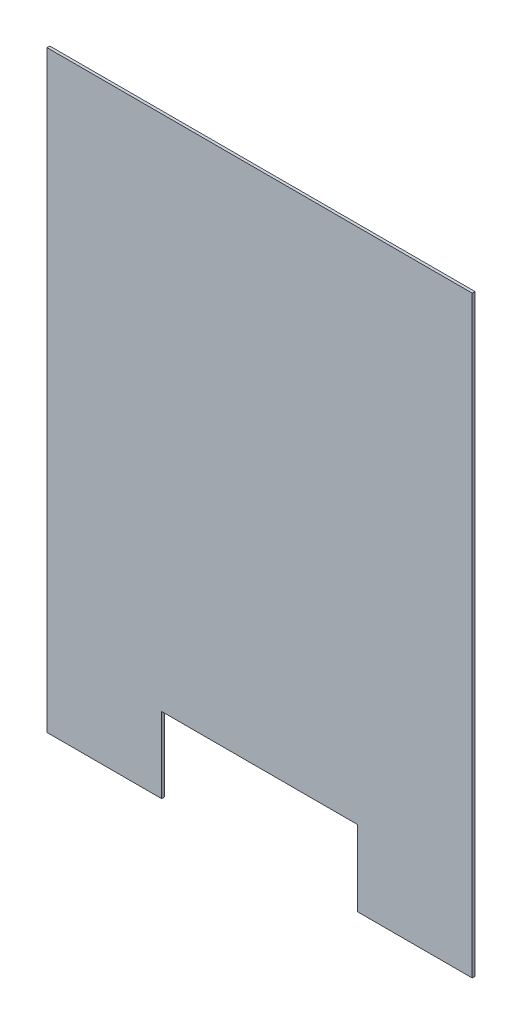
ISO-10303-21;
HEADER;
FILE_DESCRIPTION(('STEP AP214'),'2;1');
FILE_NAME('part.step','',(''),(''),'','','');
FILE_SCHEMA(('AUTOMOTIVE_DESIGN { 1 0 10303 214 1 1 1 1 }'));
ENDSEC;
DATA;
#1=APPLICATION_CONTEXT('core data for automotive mechanical design processes');
#2=APPLICATION_PROTOCOL_DEFINITION('international standard','automotive_design',2000,#1);
#3=PRODUCT_CONTEXT('',#1,'mechanical');
#4=PRODUCT('Part','Part','',(#3));
#5=PRODUCT_RELATED_PRODUCT_CATEGORY('part','',(#4));
#6=PRODUCT_DEFINITION_FORMATION('','',#4);
#7=PRODUCT_DEFINITION_CONTEXT('part definition',#1,'design');
#8=PRODUCT_DEFINITION('design','',#6,#7);
#9=PRODUCT_DEFINITION_SHAPE('','',#8);
#10=(LENGTH_UNIT() NAMED_UNIT(*) SI_UNIT(.MILLI.,.METRE.));
#11=(NAMED_UNIT(*) PLANE_ANGLE_UNIT() SI_UNIT($,.RADIAN.));
#12=(NAMED_UNIT(*) SI_UNIT($,.STERADIAN.) SOLID_ANGLE_UNIT());
#13=UNCERTAINTY_MEASURE_WITH_UNIT(LENGTH_MEASURE(1.E-05),#10,'distance_accuracy_value','');
#14=(GEOMETRIC_REPRESENTATION_CONTEXT(3) GLOBAL_UNCERTAINTY_ASSIGNED_CONTEXT((#13)) GLOBAL_UNIT_ASSIGNED_CONTEXT((#10,
#11,#12)) REPRESENTATION_CONTEXT('',''));
#15=CARTESIAN_POINT('',(0.,0.,0.));
#16=DIRECTION('',(0.,0.,1.));
#17=DIRECTION('',(1.,0.,0.));
#18=AXIS2_PLACEMENT_3D('',#15,#16,#17);
#19=CARTESIAN_POINT('',(-15.2,-21.2,5.8));
#20=DIRECTION('',(0.,1.,0.));
#21=DIRECTION('',(0.,0.,1.));
#22=AXIS2_PLACEMENT_3D('',#19,#20,#21);
#23=PLANE('',#22);
#24=DIRECTION('',(0.,0.,-1.));
#25=VECTOR('',#24,1.);
#26=CARTESIAN_POINT('',(-7.,-21.2,5.8));
#27=LINE('',#26,#25);
#28=CARTESIAN_POINT('',(-7.,-21.2,5.8));
#29=VERTEX_POINT('',#28);
#30=CARTESIAN_POINT('',(-7.,-21.2,5.6));
#31=VERTEX_POINT('',#30);
#32=EDGE_CURVE('E139',#29,#31,#27,.T.);
#33=ORIENTED_EDGE('',*,*,#32,.F.);
#34=DIRECTION('',(1.,0.,0.));
#35=VECTOR('',#34,1.);
#36=CARTESIAN_POINT('',(-15.2,-21.2,5.8));
#37=LINE('',#36,#35);
#38=CARTESIAN_POINT('',(-15.2,-21.2,5.8));
#39=VERTEX_POINT('',#38);
#40=EDGE_CURVE('E107',#39,#29,#37,.T.);
#41=ORIENTED_EDGE('',*,*,#40,.F.);
#42=DIRECTION('',(0.,0.,-1.));
#43=VECTOR('',#42,1.);
#44=CARTESIAN_POINT('',(-15.2,-21.2,5.8));
#45=LINE('',#44,#43);
#46=CARTESIAN_POINT('',(-15.2,-21.2,5.6));
#47=VERTEX_POINT('',#46);
#48=EDGE_CURVE('E51',#39,#47,#45,.T.);
#49=ORIENTED_EDGE('',*,*,#48,.T.);
#50=DIRECTION('',(1.,0.,0.));
#51=VECTOR('',#50,1.);
#52=CARTESIAN_POINT('',(-15.2,-21.2,5.6));
#53=LINE('',#52,#51);
#54=EDGE_CURVE('E134',#47,#31,#53,.T.);
#55=ORIENTED_EDGE('',*,*,#54,.T.);
#56=EDGE_LOOP('',(#33,#41,#49,#55));
#57=FACE_BOUND('',#56,.T.);
#58=ADVANCED_FACE('F41',(#57),#23,.F.);
#59=DIRECTION('',(0.,0.,1.));
#60=VECTOR('',#59,1.);
#61=CARTESIAN_POINT('',(7.,-21.2,5.8));
#62=LINE('',#61,#60);
#63=CARTESIAN_POINT('',(7.,-21.2,5.6));
#64=VERTEX_POINT('',#63);
#65=CARTESIAN_POINT('',(7.,-21.2,5.8));
#66=VERTEX_POINT('',#65);
#67=EDGE_CURVE('E147',#64,#66,#62,.T.);
#68=ORIENTED_EDGE('',*,*,#67,.F.);
#69=CARTESIAN_POINT('',(15.2,-21.2,5.6));
#70=VERTEX_POINT('',#69);
#71=EDGE_CURVE('E133',#64,#70,#53,.T.);
#72=ORIENTED_EDGE('',*,*,#71,.T.);
#73=DIRECTION('',(0.,0.,-1.));
#74=VECTOR('',#73,1.);
#75=CARTESIAN_POINT('',(15.2,-21.2,5.8));
#76=LINE('',#75,#74);
#77=CARTESIAN_POINT('',(15.2,-21.2,5.8));
#78=VERTEX_POINT('',#77);
#79=EDGE_CURVE('E116',#78,#70,#76,.T.);
#80=ORIENTED_EDGE('',*,*,#79,.F.);
#81=EDGE_CURVE('E144',#66,#78,#37,.T.);
#82=ORIENTED_EDGE('',*,*,#81,.F.);
#83=EDGE_LOOP('',(#68,#72,#80,#82));
#84=FACE_BOUND('',#83,.T.);
#85=ADVANCED_FACE('F159',(#84),#23,.F.);
#86=CARTESIAN_POINT('',(0.,0.,5.8));
#87=DIRECTION('',(0.,0.,-1.));
#88=DIRECTION('',(-1.,0.,0.));
#89=AXIS2_PLACEMENT_3D('',#86,#87,#88);
#90=PLANE('',#89);
#91=DIRECTION('',(0.,-1.,0.));
#92=VECTOR('',#91,1.);
#93=CARTESIAN_POINT('',(-7.,0.,5.8));
#94=LINE('',#93,#92);
#95=CARTESIAN_POINT('',(-7.,-15.8,5.8));
#96=VERTEX_POINT('',#95);
#97=EDGE_CURVE('E44',#96,#29,#94,.T.);
#98=ORIENTED_EDGE('',*,*,#97,.F.);
#99=DIRECTION('',(-1.,0.,0.));
#100=VECTOR('',#99,1.);
#101=CARTESIAN_POINT('',(0.,-15.8,5.8));
#102=LINE('',#101,#100);
#103=CARTESIAN_POINT('',(7.,-15.8,5.8));
#104=VERTEX_POINT('',#103);
#105=EDGE_CURVE('E82',#104,#96,#102,.T.);
#106=ORIENTED_EDGE('',*,*,#105,.F.);
#107=DIRECTION('',(0.,1.,0.));
#108=VECTOR('',#107,1.);
#109=CARTESIAN_POINT('',(7.,0.,5.8));
#110=LINE('',#109,#108);
#111=EDGE_CURVE('E94',#66,#104,#110,.T.);
#112=ORIENTED_EDGE('',*,*,#111,.F.);
#113=ORIENTED_EDGE('',*,*,#81,.T.);
#114=DIRECTION('',(0.,1.,0.));
#115=VECTOR('',#114,1.);
#116=CARTESIAN_POINT('',(15.2,-21.2,5.8));
#117=LINE('',#116,#115);
#118=CARTESIAN_POINT('',(15.2,21.2,5.8));
#119=VERTEX_POINT('',#118);
#120=EDGE_CURVE('E142',#78,#119,#117,.T.);
#121=ORIENTED_EDGE('',*,*,#120,.T.);
#122=DIRECTION('',(-1.,0.,0.));
#123=VECTOR('',#122,1.);
#124=CARTESIAN_POINT('',(-15.2,21.2,5.8));
#125=LINE('',#124,#123);
#126=CARTESIAN_POINT('',(-15.2,21.2,5.8));
#127=VERTEX_POINT('',#126);
#128=EDGE_CURVE('E124',#119,#127,#125,.T.);
#129=ORIENTED_EDGE('',*,*,#128,.T.);
#130=DIRECTION('',(0.,-1.,0.));
#131=VECTOR('',#130,1.);
#132=CARTESIAN_POINT('',(-15.2,-21.2,5.8));
#133=LINE('',#132,#131);
#134=EDGE_CURVE('E129',#127,#39,#133,.T.);
#135=ORIENTED_EDGE('',*,*,#134,.T.);
#136=ORIENTED_EDGE('',*,*,#40,.T.);
#137=EDGE_LOOP('',(#98,#106,#112,#113,#121,#129,#135,#136));
#138=FACE_BOUND('',#137,.T.);
#139=ADVANCED_FACE('F104',(#138),#90,.F.);
#140=CARTESIAN_POINT('',(0.,0.,5.6));
#141=DIRECTION('',(0.,0.,-1.));
#142=DIRECTION('',(-1.,0.,0.));
#143=AXIS2_PLACEMENT_3D('',#140,#141,#142);
#144=PLANE('',#143);
#145=DIRECTION('',(-1.,0.,0.));
#146=VECTOR('',#145,1.);
#147=CARTESIAN_POINT('',(0.,-15.8,5.6));
#148=LINE('',#147,#146);
#149=CARTESIAN_POINT('',(7.,-15.8,5.6));
#150=VERTEX_POINT('',#149);
#151=CARTESIAN_POINT('',(-7.,-15.8,5.6));
#152=VERTEX_POINT('',#151);
#153=EDGE_CURVE('E108',#150,#152,#148,.T.);
#154=ORIENTED_EDGE('',*,*,#153,.T.);
#155=DIRECTION('',(0.,1.,0.));
#156=VECTOR('',#155,1.);
#157=CARTESIAN_POINT('',(-7.,0.,5.6));
#158=LINE('',#157,#156);
#159=EDGE_CURVE('E101',#152,#31,#158,.F.);
#160=ORIENTED_EDGE('',*,*,#159,.T.);
#161=ORIENTED_EDGE('',*,*,#54,.F.);
#162=DIRECTION('',(0.,-1.,0.));
#163=VECTOR('',#162,1.);
#164=CARTESIAN_POINT('',(-15.2,-21.2,5.6));
#165=LINE('',#164,#163);
#166=CARTESIAN_POINT('',(-15.2,21.2,5.6));
#167=VERTEX_POINT('',#166);
#168=EDGE_CURVE('E140',#167,#47,#165,.T.);
#169=ORIENTED_EDGE('',*,*,#168,.F.);
#170=DIRECTION('',(-1.,0.,0.));
#171=VECTOR('',#170,1.);
#172=CARTESIAN_POINT('',(-15.2,21.2,5.6));
#173=LINE('',#172,#171);
#174=CARTESIAN_POINT('',(15.2,21.2,5.6));
#175=VERTEX_POINT('',#174);
#176=EDGE_CURVE('E127',#175,#167,#173,.T.);
#177=ORIENTED_EDGE('',*,*,#176,.F.);
#178=DIRECTION('',(0.,1.,0.));
#179=VECTOR('',#178,1.);
#180=CARTESIAN_POINT('',(15.2,-21.2,5.6));
#181=LINE('',#180,#179);
#182=EDGE_CURVE('E128',#70,#175,#181,.T.);
#183=ORIENTED_EDGE('',*,*,#182,.F.);
#184=ORIENTED_EDGE('',*,*,#71,.F.);
#185=DIRECTION('',(0.,1.,0.));
#186=VECTOR('',#185,1.);
#187=CARTESIAN_POINT('',(7.,0.,5.6));
#188=LINE('',#187,#186);
#189=EDGE_CURVE('E11',#64,#150,#188,.T.);
#190=ORIENTED_EDGE('',*,*,#189,.T.);
#191=EDGE_LOOP('',(#154,#160,#161,#169,#177,#183,#184,#190));
#192=FACE_BOUND('',#191,.T.);
#193=ADVANCED_FACE('F152',(#192),#144,.T.);
#194=CARTESIAN_POINT('',(-15.2,-21.2,5.8));
#195=DIRECTION('',(1.,0.,0.));
#196=DIRECTION('',(0.,0.,-1.));
#197=AXIS2_PLACEMENT_3D('',#194,#195,#196);
#198=PLANE('',#197);
#199=ORIENTED_EDGE('',*,*,#168,.T.);
#200=ORIENTED_EDGE('',*,*,#48,.F.);
#201=ORIENTED_EDGE('',*,*,#134,.F.);
#202=DIRECTION('',(0.,0.,-1.));
#203=VECTOR('',#202,1.);
#204=CARTESIAN_POINT('',(-15.2,21.2,5.8));
#205=LINE('',#204,#203);
#206=EDGE_CURVE('E125',#127,#167,#205,.T.);
#207=ORIENTED_EDGE('',*,*,#206,.T.);
#208=EDGE_LOOP('',(#199,#200,#201,#207));
#209=FACE_BOUND('',#208,.T.);
#210=ADVANCED_FACE('F43',(#209),#198,.F.);
#211=CARTESIAN_POINT('',(15.2,-21.2,5.8));
#212=DIRECTION('',(-1.,0.,0.));
#213=DIRECTION('',(0.,0.,1.));
#214=AXIS2_PLACEMENT_3D('',#211,#212,#213);
#215=PLANE('',#214);
#216=ORIENTED_EDGE('',*,*,#182,.T.);
#217=DIRECTION('',(0.,0.,-1.));
#218=VECTOR('',#217,1.);
#219=CARTESIAN_POINT('',(15.2,21.2,5.8));
#220=LINE('',#219,#218);
#221=EDGE_CURVE('E118',#119,#175,#220,.T.);
#222=ORIENTED_EDGE('',*,*,#221,.F.);
#223=ORIENTED_EDGE('',*,*,#120,.F.);
#224=ORIENTED_EDGE('',*,*,#79,.T.);
#225=EDGE_LOOP('',(#216,#222,#223,#224));
#226=FACE_BOUND('',#225,.T.);
#227=ADVANCED_FACE('F169',(#226),#215,.F.);
#228=CARTESIAN_POINT('',(-15.2,21.2,5.8));
#229=DIRECTION('',(0.,-1.,0.));
#230=DIRECTION('',(0.,0.,-1.));
#231=AXIS2_PLACEMENT_3D('',#228,#229,#230);
#232=PLANE('',#231);
#233=ORIENTED_EDGE('',*,*,#176,.T.);
#234=ORIENTED_EDGE('',*,*,#206,.F.);
#235=ORIENTED_EDGE('',*,*,#128,.F.);
#236=ORIENTED_EDGE('',*,*,#221,.T.);
#237=EDGE_LOOP('',(#233,#234,#235,#236));
#238=FACE_BOUND('',#237,.T.);
#239=ADVANCED_FACE('F183',(#238),#232,.F.);
#240=CARTESIAN_POINT('',(-7.,-22.2,5.81));
#241=DIRECTION('',(1.,0.,0.));
#242=DIRECTION('',(0.,0.,-1.));
#243=AXIS2_PLACEMENT_3D('',#240,#241,#242);
#244=PLANE('',#243);
#245=ORIENTED_EDGE('',*,*,#32,.T.);
#246=ORIENTED_EDGE('',*,*,#159,.F.);
#247=DIRECTION('',(0.,0.,-1.));
#248=VECTOR('',#247,1.);
#249=CARTESIAN_POINT('',(-7.,-15.8,5.81));
#250=LINE('',#249,#248);
#251=EDGE_CURVE('E86',#96,#152,#250,.T.);
#252=ORIENTED_EDGE('',*,*,#251,.F.);
#253=ORIENTED_EDGE('',*,*,#97,.T.);
#254=EDGE_LOOP('',(#245,#246,#252,#253));
#255=FACE_BOUND('',#254,.T.);
#256=ADVANCED_FACE('F98',(#255),#244,.T.);
#257=CARTESIAN_POINT('',(7.,-22.2,5.81));
#258=DIRECTION('',(-1.,0.,0.));
#259=DIRECTION('',(0.,0.,1.));
#260=AXIS2_PLACEMENT_3D('',#257,#258,#259);
#261=PLANE('',#260);
#262=ORIENTED_EDGE('',*,*,#67,.T.);
#263=ORIENTED_EDGE('',*,*,#111,.T.);
#264=DIRECTION('',(0.,0.,-1.));
#265=VECTOR('',#264,1.);
#266=CARTESIAN_POINT('',(7.,-15.8,5.81));
#267=LINE('',#266,#265);
#268=EDGE_CURVE('E89',#104,#150,#267,.T.);
#269=ORIENTED_EDGE('',*,*,#268,.T.);
#270=ORIENTED_EDGE('',*,*,#189,.F.);
#271=EDGE_LOOP('',(#262,#263,#269,#270));
#272=FACE_BOUND('',#271,.T.);
#273=ADVANCED_FACE('F155',(#272),#261,.T.);
#274=CARTESIAN_POINT('',(-7.,-15.8,5.81));
#275=DIRECTION('',(0.,-1.,0.));
#276=DIRECTION('',(0.,0.,-1.));
#277=AXIS2_PLACEMENT_3D('',#274,#275,#276);
#278=PLANE('',#277);
#279=ORIENTED_EDGE('',*,*,#153,.F.);
#280=ORIENTED_EDGE('',*,*,#268,.F.);
#281=ORIENTED_EDGE('',*,*,#105,.T.);
#282=ORIENTED_EDGE('',*,*,#251,.T.);
#283=EDGE_LOOP('',(#279,#280,#281,#282));
#284=FACE_BOUND('',#283,.T.);
#285=ADVANCED_FACE('F87',(#284),#278,.T.);
#286=CLOSED_SHELL('',(#58,#85,#139,#193,#210,#227,#239,#256,#273,#285));
#287=MANIFOLD_SOLID_BREP('B2',#286);
#288=ADVANCED_BREP_SHAPE_REPRESENTATION('',(#18,#287),#14);
#289=SHAPE_DEFINITION_REPRESENTATION(#9,#288);
ENDSEC;
END-ISO-10303-21;
